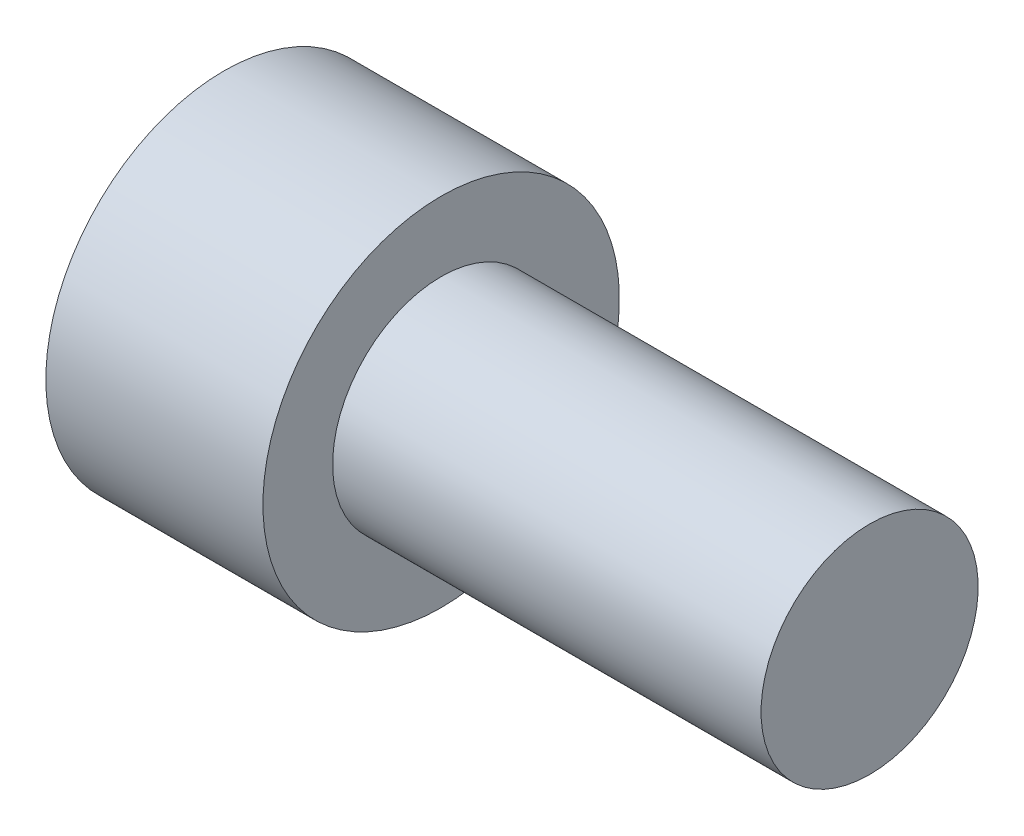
ISO-10303-21;
HEADER;
FILE_DESCRIPTION(('STEP AP214'),'2;1');
FILE_NAME('part.step','',(''),(''),'','','');
FILE_SCHEMA(('AUTOMOTIVE_DESIGN { 1 0 10303 214 1 1 1 1 }'));
ENDSEC;
DATA;
#1=APPLICATION_CONTEXT('core data for automotive mechanical design processes');
#2=APPLICATION_PROTOCOL_DEFINITION('international standard','automotive_design',2000,#1);
#3=PRODUCT_CONTEXT('',#1,'mechanical');
#4=PRODUCT('Part','Part','',(#3));
#5=PRODUCT_RELATED_PRODUCT_CATEGORY('part','',(#4));
#6=PRODUCT_DEFINITION_FORMATION('','',#4);
#7=PRODUCT_DEFINITION_CONTEXT('part definition',#1,'design');
#8=PRODUCT_DEFINITION('design','',#6,#7);
#9=PRODUCT_DEFINITION_SHAPE('','',#8);
#10=(LENGTH_UNIT() NAMED_UNIT(*) SI_UNIT(.MILLI.,.METRE.));
#11=(NAMED_UNIT(*) PLANE_ANGLE_UNIT() SI_UNIT($,.RADIAN.));
#12=(NAMED_UNIT(*) SI_UNIT($,.STERADIAN.) SOLID_ANGLE_UNIT());
#13=UNCERTAINTY_MEASURE_WITH_UNIT(LENGTH_MEASURE(1.E-05),#10,'distance_accuracy_value','');
#14=(GEOMETRIC_REPRESENTATION_CONTEXT(3) GLOBAL_UNCERTAINTY_ASSIGNED_CONTEXT((#13)) GLOBAL_UNIT_ASSIGNED_CONTEXT((#10,
#11,#12)) REPRESENTATION_CONTEXT('',''));
#15=CARTESIAN_POINT('',(0.,0.,0.));
#16=DIRECTION('',(0.,0.,1.));
#17=DIRECTION('',(1.,0.,0.));
#18=AXIS2_PLACEMENT_3D('',#15,#16,#17);
#19=CARTESIAN_POINT('',(9.525,0.,0.));
#20=DIRECTION('',(1.,0.,0.));
#21=DIRECTION('',(0.,1.,0.));
#22=AXIS2_PLACEMENT_3D('',#19,#20,#21);
#23=PLANE('',#22);
#24=CARTESIAN_POINT('',(9.525,0.,0.));
#25=DIRECTION('',(1.,0.,0.));
#26=DIRECTION('',(0.,1.,0.));
#27=AXIS2_PLACEMENT_3D('',#24,#25,#26);
#28=CIRCLE('',#27,2.413);
#29=CARTESIAN_POINT('',(9.525,2.413,0.));
#30=VERTEX_POINT('',#29);
#31=EDGE_CURVE('E11',#30,#30,#28,.T.);
#32=ORIENTED_EDGE('',*,*,#31,.T.);
#33=EDGE_LOOP('',(#32));
#34=FACE_BOUND('',#33,.T.);
#35=ADVANCED_FACE('F380',(#34),#23,.T.);
#36=CARTESIAN_POINT('',(9.525,0.,0.));
#37=DIRECTION('',(1.,0.,0.));
#38=DIRECTION('',(0.,1.,0.));
#39=AXIS2_PLACEMENT_3D('',#36,#37,#38);
#40=CYLINDRICAL_SURFACE('',#39,2.413);
#41=CARTESIAN_POINT('',(0.,0.,0.));
#42=DIRECTION('',(1.,0.,0.));
#43=DIRECTION('',(0.,1.,0.));
#44=AXIS2_PLACEMENT_3D('',#41,#42,#43);
#45=CIRCLE('',#44,2.413);
#46=CARTESIAN_POINT('',(0.,2.413,0.));
#47=VERTEX_POINT('',#46);
#48=EDGE_CURVE('E387',#47,#47,#45,.T.);
#49=ORIENTED_EDGE('',*,*,#48,.T.);
#50=EDGE_LOOP('',(#49));
#51=FACE_BOUND('',#50,.T.);
#52=ORIENTED_EDGE('',*,*,#31,.F.);
#53=EDGE_LOOP('',(#52));
#54=FACE_BOUND('',#53,.T.);
#55=ADVANCED_FACE('F496',(#51,#54),#40,.T.);
#56=CARTESIAN_POINT('',(0.,3.9624,0.));
#57=DIRECTION('',(1.,0.,0.));
#58=DIRECTION('',(0.,1.,0.));
#59=AXIS2_PLACEMENT_3D('',#56,#57,#58);
#60=PLANE('',#59);
#61=CARTESIAN_POINT('',(0.,0.,0.));
#62=DIRECTION('',(1.,0.,0.));
#63=DIRECTION('',(0.,1.,0.));
#64=AXIS2_PLACEMENT_3D('',#61,#62,#63);
#65=CIRCLE('',#64,3.9624);
#66=CARTESIAN_POINT('',(0.,3.9624,0.));
#67=VERTEX_POINT('',#66);
#68=EDGE_CURVE('E491',#67,#67,#65,.T.);
#69=ORIENTED_EDGE('',*,*,#68,.T.);
#70=EDGE_LOOP('',(#69));
#71=FACE_BOUND('',#70,.T.);
#72=ORIENTED_EDGE('',*,*,#48,.F.);
#73=EDGE_LOOP('',(#72));
#74=FACE_BOUND('',#73,.T.);
#75=ADVANCED_FACE('F499',(#71,#74),#60,.T.);
#76=CARTESIAN_POINT('',(9.525,0.,0.));
#77=DIRECTION('',(1.,0.,0.));
#78=DIRECTION('',(0.,1.,0.));
#79=AXIS2_PLACEMENT_3D('',#76,#77,#78);
#80=CYLINDRICAL_SURFACE('',#79,3.9624);
#81=CARTESIAN_POINT('',(-4.826,0.,0.));
#82=DIRECTION('',(1.,0.,0.));
#83=DIRECTION('',(0.,1.,0.));
#84=AXIS2_PLACEMENT_3D('',#81,#82,#83);
#85=CIRCLE('',#84,3.9624);
#86=CARTESIAN_POINT('',(-4.826,3.9624,0.));
#87=VERTEX_POINT('',#86);
#88=EDGE_CURVE('E482',#87,#87,#85,.T.);
#89=ORIENTED_EDGE('',*,*,#88,.T.);
#90=EDGE_LOOP('',(#89));
#91=FACE_BOUND('',#90,.T.);
#92=ORIENTED_EDGE('',*,*,#68,.F.);
#93=EDGE_LOOP('',(#92));
#94=FACE_BOUND('',#93,.T.);
#95=ADVANCED_FACE('F501',(#91,#94),#80,.T.);
#96=CARTESIAN_POINT('',(-4.826,0.,0.));
#97=DIRECTION('',(-1.,0.,0.));
#98=DIRECTION('',(0.,-1.,0.));
#99=AXIS2_PLACEMENT_3D('',#96,#97,#98);
#100=PLANE('',#99);
#101=DIRECTION('',(0.,0.866025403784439,0.5));
#102=VECTOR('',#101,1.);
#103=CARTESIAN_POINT('',(-4.826,-2.159,1.2464992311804));
#104=LINE('',#103,#102);
#105=CARTESIAN_POINT('',(-4.826,-2.159,1.2464992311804));
#106=VERTEX_POINT('',#105);
#107=CARTESIAN_POINT('',(-4.826,0.,2.4929984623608));
#108=VERTEX_POINT('',#107);
#109=EDGE_CURVE('E394',#106,#108,#104,.T.);
#110=ORIENTED_EDGE('',*,*,#109,.F.);
#111=DIRECTION('',(0.,0.,1.));
#112=VECTOR('',#111,1.);
#113=CARTESIAN_POINT('',(-4.826,-2.159,-1.2464992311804));
#114=LINE('',#113,#112);
#115=CARTESIAN_POINT('',(-4.826,-2.159,-1.2464992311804));
#116=VERTEX_POINT('',#115);
#117=EDGE_CURVE('E464',#116,#106,#114,.T.);
#118=ORIENTED_EDGE('',*,*,#117,.F.);
#119=DIRECTION('',(0.,-0.866025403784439,0.5));
#120=VECTOR('',#119,1.);
#121=CARTESIAN_POINT('',(-4.826,0.,-2.4929984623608));
#122=LINE('',#121,#120);
#123=CARTESIAN_POINT('',(-4.826,0.,-2.4929984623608));
#124=VERTEX_POINT('',#123);
#125=EDGE_CURVE('E458',#124,#116,#122,.T.);
#126=ORIENTED_EDGE('',*,*,#125,.F.);
#127=DIRECTION('',(0.,-0.866025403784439,-0.5));
#128=VECTOR('',#127,1.);
#129=CARTESIAN_POINT('',(-4.826,2.159,-1.2464992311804));
#130=LINE('',#129,#128);
#131=CARTESIAN_POINT('',(-4.826,2.159,-1.2464992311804));
#132=VERTEX_POINT('',#131);
#133=EDGE_CURVE('E456',#132,#124,#130,.T.);
#134=ORIENTED_EDGE('',*,*,#133,.F.);
#135=DIRECTION('',(0.,0.,-1.));
#136=VECTOR('',#135,1.);
#137=CARTESIAN_POINT('',(-4.826,2.159,1.2464992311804));
#138=LINE('',#137,#136);
#139=CARTESIAN_POINT('',(-4.826,2.159,1.2464992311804));
#140=VERTEX_POINT('',#139);
#141=EDGE_CURVE('E437',#140,#132,#138,.T.);
#142=ORIENTED_EDGE('',*,*,#141,.F.);
#143=DIRECTION('',(0.,0.866025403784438,-0.5));
#144=VECTOR('',#143,1.);
#145=CARTESIAN_POINT('',(-4.826,0.,2.4929984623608));
#146=LINE('',#145,#144);
#147=EDGE_CURVE('E448',#108,#140,#146,.T.);
#148=ORIENTED_EDGE('',*,*,#147,.F.);
#149=EDGE_LOOP('',(#110,#118,#126,#134,#142,#148));
#150=FACE_BOUND('',#149,.T.);
#151=ORIENTED_EDGE('',*,*,#88,.F.);
#152=EDGE_LOOP('',(#151));
#153=FACE_BOUND('',#152,.T.);
#154=ADVANCED_FACE('F452',(#150,#153),#100,.T.);
#155=CARTESIAN_POINT('',(-2.54,-2.159,1.2464992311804));
#156=DIRECTION('',(0.,-0.5,0.866025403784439));
#157=DIRECTION('',(0.,-0.866025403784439,-0.5));
#158=AXIS2_PLACEMENT_3D('',#155,#156,#157);
#159=PLANE('',#158);
#160=ORIENTED_EDGE('',*,*,#109,.T.);
#161=DIRECTION('',(-1.,0.,0.));
#162=VECTOR('',#161,1.);
#163=CARTESIAN_POINT('',(-2.54,0.,2.4929984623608));
#164=LINE('',#163,#162);
#165=CARTESIAN_POINT('',(-2.54,0.,2.4929984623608));
#166=VERTEX_POINT('',#165);
#167=EDGE_CURVE('E445',#166,#108,#164,.T.);
#168=ORIENTED_EDGE('',*,*,#167,.F.);
#169=DIRECTION('',(0.,0.866025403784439,0.5));
#170=VECTOR('',#169,1.);
#171=CARTESIAN_POINT('',(-2.54,-2.159,1.2464992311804));
#172=LINE('',#171,#170);
#173=CARTESIAN_POINT('',(-2.54,-2.159,1.2464992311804));
#174=VERTEX_POINT('',#173);
#175=EDGE_CURVE('E466',#174,#166,#172,.T.);
#176=ORIENTED_EDGE('',*,*,#175,.F.);
#177=DIRECTION('',(-1.,0.,0.));
#178=VECTOR('',#177,1.);
#179=CARTESIAN_POINT('',(-2.54,-2.159,1.2464992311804));
#180=LINE('',#179,#178);
#181=EDGE_CURVE('E401',#174,#106,#180,.T.);
#182=ORIENTED_EDGE('',*,*,#181,.T.);
#183=EDGE_LOOP('',(#160,#168,#176,#182));
#184=FACE_BOUND('',#183,.T.);
#185=ADVANCED_FACE('F532',(#184),#159,.F.);
#186=CARTESIAN_POINT('',(-2.54,-2.159,-1.2464992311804));
#187=DIRECTION('',(0.,-1.,0.));
#188=DIRECTION('',(1.,0.,0.));
#189=AXIS2_PLACEMENT_3D('',#186,#187,#188);
#190=PLANE('',#189);
#191=ORIENTED_EDGE('',*,*,#117,.T.);
#192=ORIENTED_EDGE('',*,*,#181,.F.);
#193=DIRECTION('',(0.,0.,1.));
#194=VECTOR('',#193,1.);
#195=CARTESIAN_POINT('',(-2.54,-2.159,-1.2464992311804));
#196=LINE('',#195,#194);
#197=CARTESIAN_POINT('',(-2.54,-2.159,-1.2464992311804));
#198=VERTEX_POINT('',#197);
#199=EDGE_CURVE('E478',#198,#174,#196,.T.);
#200=ORIENTED_EDGE('',*,*,#199,.F.);
#201=DIRECTION('',(-1.,0.,0.));
#202=VECTOR('',#201,1.);
#203=CARTESIAN_POINT('',(-2.54,-2.159,-1.2464992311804));
#204=LINE('',#203,#202);
#205=EDGE_CURVE('E483',#198,#116,#204,.T.);
#206=ORIENTED_EDGE('',*,*,#205,.T.);
#207=EDGE_LOOP('',(#191,#192,#200,#206));
#208=FACE_BOUND('',#207,.T.);
#209=ADVANCED_FACE('F539',(#208),#190,.F.);
#210=CARTESIAN_POINT('',(-2.54,0.,-2.4929984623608));
#211=DIRECTION('',(0.,-0.5,-0.866025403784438));
#212=DIRECTION('',(0.,0.866025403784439,-0.5));
#213=AXIS2_PLACEMENT_3D('',#210,#211,#212);
#214=PLANE('',#213);
#215=ORIENTED_EDGE('',*,*,#125,.T.);
#216=ORIENTED_EDGE('',*,*,#205,.F.);
#217=DIRECTION('',(0.,-0.866025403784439,0.5));
#218=VECTOR('',#217,1.);
#219=CARTESIAN_POINT('',(-2.54,0.,-2.4929984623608));
#220=LINE('',#219,#218);
#221=CARTESIAN_POINT('',(-2.54,0.,-2.4929984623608));
#222=VERTEX_POINT('',#221);
#223=EDGE_CURVE('E475',#222,#198,#220,.T.);
#224=ORIENTED_EDGE('',*,*,#223,.F.);
#225=DIRECTION('',(-1.,0.,0.));
#226=VECTOR('',#225,1.);
#227=CARTESIAN_POINT('',(-2.54,0.,-2.4929984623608));
#228=LINE('',#227,#226);
#229=EDGE_CURVE('E485',#222,#124,#228,.T.);
#230=ORIENTED_EDGE('',*,*,#229,.T.);
#231=EDGE_LOOP('',(#215,#216,#224,#230));
#232=FACE_BOUND('',#231,.T.);
#233=ADVANCED_FACE('F546',(#232),#214,.F.);
#234=CARTESIAN_POINT('',(-2.54,2.159,-1.2464992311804));
#235=DIRECTION('',(0.,0.5,-0.866025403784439));
#236=DIRECTION('',(0.,0.866025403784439,0.5));
#237=AXIS2_PLACEMENT_3D('',#234,#235,#236);
#238=PLANE('',#237);
#239=ORIENTED_EDGE('',*,*,#133,.T.);
#240=ORIENTED_EDGE('',*,*,#229,.F.);
#241=DIRECTION('',(0.,-0.866025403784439,-0.5));
#242=VECTOR('',#241,1.);
#243=CARTESIAN_POINT('',(-2.54,2.159,-1.2464992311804));
#244=LINE('',#243,#242);
#245=CARTESIAN_POINT('',(-2.54,2.159,-1.2464992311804));
#246=VERTEX_POINT('',#245);
#247=EDGE_CURVE('E472',#246,#222,#244,.T.);
#248=ORIENTED_EDGE('',*,*,#247,.F.);
#249=DIRECTION('',(-1.,0.,0.));
#250=VECTOR('',#249,1.);
#251=CARTESIAN_POINT('',(-2.54,2.159,-1.2464992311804));
#252=LINE('',#251,#250);
#253=EDGE_CURVE('E444',#246,#132,#252,.T.);
#254=ORIENTED_EDGE('',*,*,#253,.T.);
#255=EDGE_LOOP('',(#239,#240,#248,#254));
#256=FACE_BOUND('',#255,.T.);
#257=ADVANCED_FACE('F553',(#256),#238,.F.);
#258=CARTESIAN_POINT('',(-2.54,2.159,1.2464992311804));
#259=DIRECTION('',(0.,1.,0.));
#260=DIRECTION('',(-1.,0.,0.));
#261=AXIS2_PLACEMENT_3D('',#258,#259,#260);
#262=PLANE('',#261);
#263=ORIENTED_EDGE('',*,*,#141,.T.);
#264=ORIENTED_EDGE('',*,*,#253,.F.);
#265=DIRECTION('',(0.,0.,-1.));
#266=VECTOR('',#265,1.);
#267=CARTESIAN_POINT('',(-2.54,2.159,1.2464992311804));
#268=LINE('',#267,#266);
#269=CARTESIAN_POINT('',(-2.54,2.159,1.2464992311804));
#270=VERTEX_POINT('',#269);
#271=EDGE_CURVE('E440',#270,#246,#268,.T.);
#272=ORIENTED_EDGE('',*,*,#271,.F.);
#273=DIRECTION('',(-1.,0.,0.));
#274=VECTOR('',#273,1.);
#275=CARTESIAN_POINT('',(-2.54,2.159,1.2464992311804));
#276=LINE('',#275,#274);
#277=EDGE_CURVE('E433',#270,#140,#276,.T.);
#278=ORIENTED_EDGE('',*,*,#277,.T.);
#279=EDGE_LOOP('',(#263,#264,#272,#278));
#280=FACE_BOUND('',#279,.T.);
#281=ADVANCED_FACE('F435',(#280),#262,.F.);
#282=CARTESIAN_POINT('',(-2.54,0.,2.4929984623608));
#283=DIRECTION('',(0.,0.5,0.866025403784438));
#284=DIRECTION('',(0.,-0.866025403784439,0.5));
#285=AXIS2_PLACEMENT_3D('',#282,#283,#284);
#286=PLANE('',#285);
#287=ORIENTED_EDGE('',*,*,#147,.T.);
#288=ORIENTED_EDGE('',*,*,#277,.F.);
#289=DIRECTION('',(0.,0.866025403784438,-0.5));
#290=VECTOR('',#289,1.);
#291=CARTESIAN_POINT('',(-2.54,0.,2.4929984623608));
#292=LINE('',#291,#290);
#293=EDGE_CURVE('E469',#166,#270,#292,.T.);
#294=ORIENTED_EDGE('',*,*,#293,.F.);
#295=ORIENTED_EDGE('',*,*,#167,.T.);
#296=EDGE_LOOP('',(#287,#288,#294,#295));
#297=FACE_BOUND('',#296,.T.);
#298=ADVANCED_FACE('F449',(#297),#286,.F.);
#299=CARTESIAN_POINT('',(-2.54,2.159,3.7394976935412));
#300=DIRECTION('',(-1.,0.,0.));
#301=DIRECTION('',(0.,0.,1.));
#302=AXIS2_PLACEMENT_3D('',#299,#300,#301);
#303=PLANE('',#302);
#304=ORIENTED_EDGE('',*,*,#175,.T.);
#305=ORIENTED_EDGE('',*,*,#293,.T.);
#306=ORIENTED_EDGE('',*,*,#271,.T.);
#307=ORIENTED_EDGE('',*,*,#247,.T.);
#308=ORIENTED_EDGE('',*,*,#223,.T.);
#309=ORIENTED_EDGE('',*,*,#199,.T.);
#310=EDGE_LOOP('',(#304,#305,#306,#307,#308,#309));
#311=FACE_BOUND('',#310,.T.);
#312=ADVANCED_FACE('F574',(#311),#303,.T.);
#313=CLOSED_SHELL('',(#35,#55,#75,#95,#154,#185,#209,#233,#257,#281,#298,#312));
#314=MANIFOLD_SOLID_BREP('B2',#313);
#315=ADVANCED_BREP_SHAPE_REPRESENTATION('',(#18,#314),#14);
#316=SHAPE_DEFINITION_REPRESENTATION(#9,#315);
ENDSEC;
END-ISO-10303-21;
